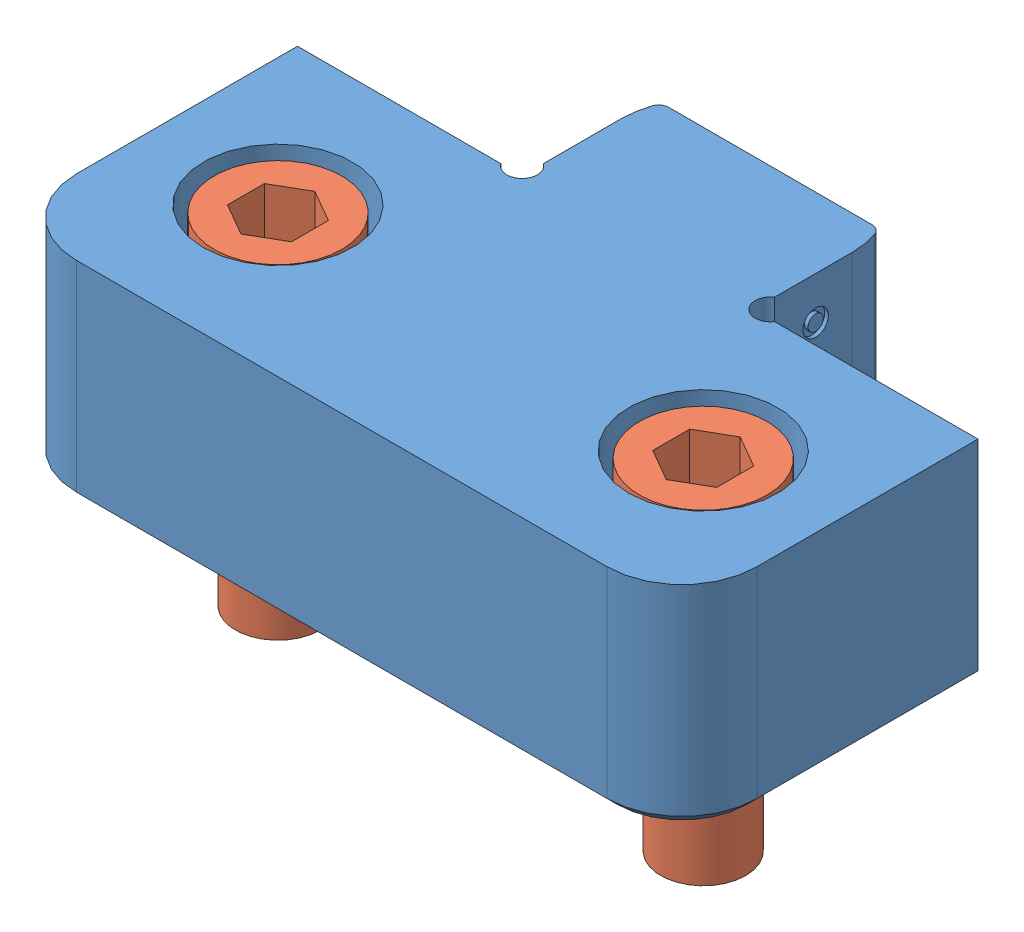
SolidWorks assembly SL62X200-M.SLDASM, configuration Default (file format 13000). Lengths in mm.
Overall size (50.8 25.91 32).
3 component instances, 2 part files, 5 mates.
Components (placement in the parent):
- SL62X200 MALE-1: SL62X200 MALE.sldprt [Default] at origin size (50.8 15.75 32)
- SHCS25-20L.75-1: SHCS25-20L.75.sldprt [SHCS25-20L.75] at (15.875 -6.858 10.9855) x (1 0 0) z (0 -1 0) size (9.53 9.53 25.4)
- SHCS25-20L.75-2: SHCS25-20L.75.sldprt [SHCS25-20L.75] at (-15.875 -6.858 10.9855) x (1 0 0) z (0 -1 0) size (9.53 9.53 25.4)
Mates (geometry in assembly coordinates):
- Coincident1: coincident aligned: plane of SLC62X200 MALE-1 through (0 0 0) normal (0 0 1); plane of assembly through (0 0 0) normal (0 0 1)
- Coincident2: coincident aligned: plane of SLC62X200 MALE-1 through (0 0 0) normal (0 1 0); plane of assembly through (0 0 0) normal (0 1 0)
- Coincident3: coincident aligned: plane of SLC62X200 MALE-1 through (0 0 0) normal (1 0 0); plane of assembly through (0 0 0) normal (1 0 0)
- Coincident4: coincident anti-aligned: plane of SLC62X200 MALE-1 through (19.4437 -6.858 10.9855) normal (0 1 0); plane of SHCS25L.75-1 through (15.875 -6.858 7.8105) normal (0 -1 0)
- Concentric1: concentric anti-aligned: cylinder of SLC62X200 MALE-1 through (15.875 0 10.9855) axis (0 1 0) radius 3.5687; cylinder of SHCS25L.75-1 through (15.875 -25.908 10.9855) axis (0 -1 0) radius 3.175
